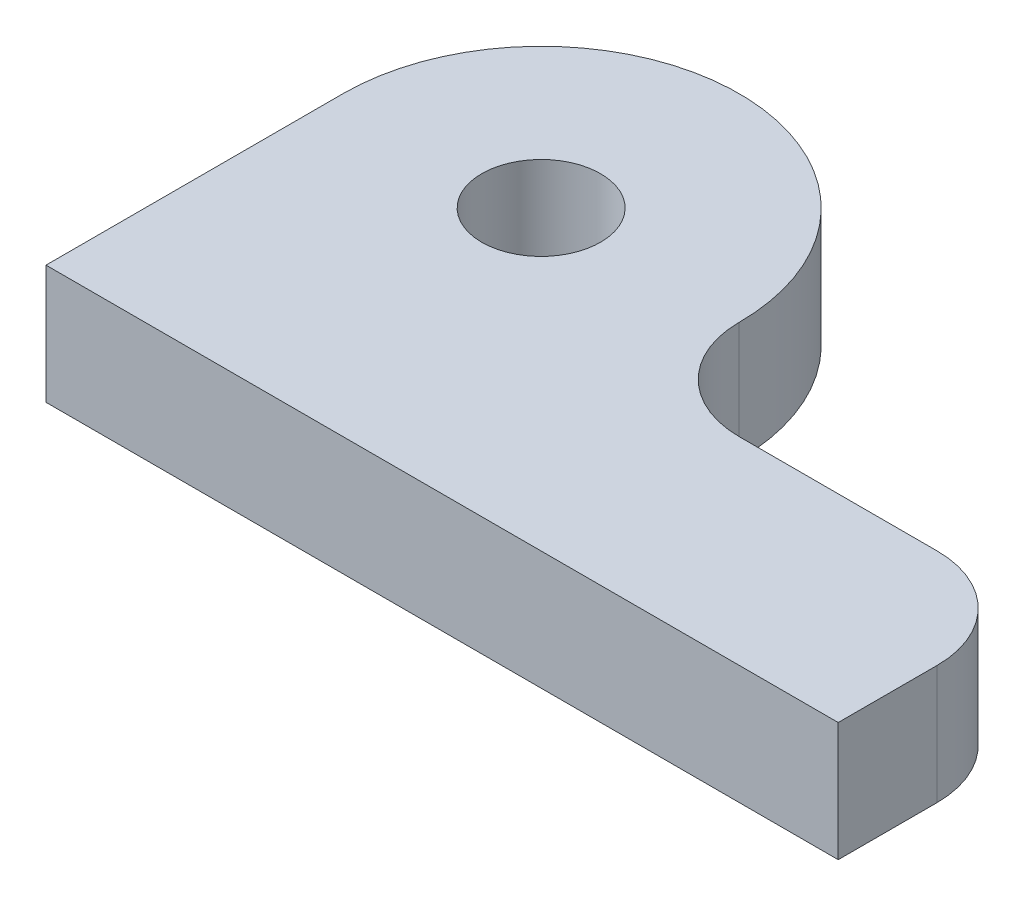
ISO-10303-21;
HEADER;
FILE_DESCRIPTION(('STEP AP214'),'2;1');
FILE_NAME('part.step','',(''),(''),'','','');
FILE_SCHEMA(('AUTOMOTIVE_DESIGN { 1 0 10303 214 1 1 1 1 }'));
ENDSEC;
DATA;
#1=APPLICATION_CONTEXT('core data for automotive mechanical design processes');
#2=APPLICATION_PROTOCOL_DEFINITION('international standard','automotive_design',2000,#1);
#3=PRODUCT_CONTEXT('',#1,'mechanical');
#4=PRODUCT('Part','Part','',(#3));
#5=PRODUCT_RELATED_PRODUCT_CATEGORY('part','',(#4));
#6=PRODUCT_DEFINITION_FORMATION('','',#4);
#7=PRODUCT_DEFINITION_CONTEXT('part definition',#1,'design');
#8=PRODUCT_DEFINITION('design','',#6,#7);
#9=PRODUCT_DEFINITION_SHAPE('','',#8);
#10=(LENGTH_UNIT() NAMED_UNIT(*) SI_UNIT(.MILLI.,.METRE.));
#11=(NAMED_UNIT(*) PLANE_ANGLE_UNIT() SI_UNIT($,.RADIAN.));
#12=(NAMED_UNIT(*) SI_UNIT($,.STERADIAN.) SOLID_ANGLE_UNIT());
#13=UNCERTAINTY_MEASURE_WITH_UNIT(LENGTH_MEASURE(1.E-05),#10,'distance_accuracy_value','');
#14=(GEOMETRIC_REPRESENTATION_CONTEXT(3) GLOBAL_UNCERTAINTY_ASSIGNED_CONTEXT((#13)) GLOBAL_UNIT_ASSIGNED_CONTEXT((#10,
#11,#12)) REPRESENTATION_CONTEXT('',''));
#15=CARTESIAN_POINT('',(0.,0.,0.));
#16=DIRECTION('',(0.,0.,1.));
#17=DIRECTION('',(1.,0.,0.));
#18=AXIS2_PLACEMENT_3D('',#15,#16,#17);
#19=CARTESIAN_POINT('',(10.,6.,-15.));
#20=DIRECTION('',(0.,1.,0.));
#21=DIRECTION('',(0.,0.,1.));
#22=AXIS2_PLACEMENT_3D('',#19,#20,#21);
#23=PLANE('',#22);
#24=CARTESIAN_POINT('',(10.,6.,-15.));
#25=DIRECTION('',(0.,1.,0.));
#26=DIRECTION('',(0.,0.,1.));
#27=AXIS2_PLACEMENT_3D('',#24,#25,#26);
#28=CIRCLE('',#27,10.);
#29=CARTESIAN_POINT('',(20.,6.,-15.));
#30=VERTEX_POINT('',#29);
#31=CARTESIAN_POINT('',(0.,6.,-15.));
#32=VERTEX_POINT('',#31);
#33=EDGE_CURVE('E111',#30,#32,#28,.T.);
#34=ORIENTED_EDGE('',*,*,#33,.T.);
#35=DIRECTION('',(0.,0.,1.));
#36=VECTOR('',#35,1.);
#37=CARTESIAN_POINT('',(0.,6.,0.));
#38=LINE('',#37,#36);
#39=CARTESIAN_POINT('',(0.,6.,0.));
#40=VERTEX_POINT('',#39);
#41=EDGE_CURVE('E90',#32,#40,#38,.T.);
#42=ORIENTED_EDGE('',*,*,#41,.T.);
#43=DIRECTION('',(1.,0.,0.));
#44=VECTOR('',#43,1.);
#45=CARTESIAN_POINT('',(40.,6.,0.));
#46=LINE('',#45,#44);
#47=CARTESIAN_POINT('',(40.,6.,0.));
#48=VERTEX_POINT('',#47);
#49=EDGE_CURVE('E114',#40,#48,#46,.T.);
#50=ORIENTED_EDGE('',*,*,#49,.T.);
#51=DIRECTION('',(0.,0.,-1.));
#52=VECTOR('',#51,1.);
#53=CARTESIAN_POINT('',(40.,6.,-4.99999999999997));
#54=LINE('',#53,#52);
#55=CARTESIAN_POINT('',(40.,6.,-4.99999999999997));
#56=VERTEX_POINT('',#55);
#57=EDGE_CURVE('E116',#48,#56,#54,.T.);
#58=ORIENTED_EDGE('',*,*,#57,.T.);
#59=CARTESIAN_POINT('',(35.,6.,-5.));
#60=DIRECTION('',(0.,1.,0.));
#61=DIRECTION('',(0.,0.,-1.));
#62=AXIS2_PLACEMENT_3D('',#59,#60,#61);
#63=CIRCLE('',#62,5.);
#64=CARTESIAN_POINT('',(35.,6.,-10.));
#65=VERTEX_POINT('',#64);
#66=EDGE_CURVE('E118',#56,#65,#63,.T.);
#67=ORIENTED_EDGE('',*,*,#66,.T.);
#68=DIRECTION('',(-1.,0.,0.));
#69=VECTOR('',#68,1.);
#70=CARTESIAN_POINT('',(25.,6.,-10.));
#71=LINE('',#70,#69);
#72=CARTESIAN_POINT('',(25.,6.,-10.));
#73=VERTEX_POINT('',#72);
#74=EDGE_CURVE('E37',#65,#73,#71,.T.);
#75=ORIENTED_EDGE('',*,*,#74,.T.);
#76=CARTESIAN_POINT('',(25.,6.,-15.));
#77=DIRECTION('',(0.,-1.,0.));
#78=DIRECTION('',(0.,0.,1.));
#79=AXIS2_PLACEMENT_3D('',#76,#77,#78);
#80=CIRCLE('',#79,5.);
#81=EDGE_CURVE('E32',#73,#30,#80,.T.);
#82=ORIENTED_EDGE('',*,*,#81,.T.);
#83=EDGE_LOOP('',(#34,#42,#50,#58,#67,#75,#82));
#84=FACE_BOUND('',#83,.T.);
#85=CARTESIAN_POINT('',(10.,6.,-15.));
#86=DIRECTION('',(0.,1.,0.));
#87=DIRECTION('',(0.,0.,1.));
#88=AXIS2_PLACEMENT_3D('',#85,#86,#87);
#89=CIRCLE('',#88,3.);
#90=CARTESIAN_POINT('',(10.,6.,-12.));
#91=VERTEX_POINT('',#90);
#92=EDGE_CURVE('E95',#91,#91,#89,.T.);
#93=ORIENTED_EDGE('',*,*,#92,.F.);
#94=EDGE_LOOP('',(#93));
#95=FACE_BOUND('',#94,.T.);
#96=ADVANCED_FACE('F17',(#84,#95),#23,.T.);
#97=CARTESIAN_POINT('',(10.,0.,-15.));
#98=DIRECTION('',(0.,1.,0.));
#99=DIRECTION('',(0.,0.,1.));
#100=AXIS2_PLACEMENT_3D('',#97,#98,#99);
#101=PLANE('',#100);
#102=CARTESIAN_POINT('',(10.,0.,-15.));
#103=DIRECTION('',(0.,1.,0.));
#104=DIRECTION('',(0.,0.,1.));
#105=AXIS2_PLACEMENT_3D('',#102,#103,#104);
#106=CIRCLE('',#105,10.);
#107=CARTESIAN_POINT('',(20.,0.,-15.));
#108=VERTEX_POINT('',#107);
#109=CARTESIAN_POINT('',(0.,0.,-15.));
#110=VERTEX_POINT('',#109);
#111=EDGE_CURVE('E81',#108,#110,#106,.T.);
#112=ORIENTED_EDGE('',*,*,#111,.F.);
#113=CARTESIAN_POINT('',(25.,0.,-15.));
#114=DIRECTION('',(0.,-1.,0.));
#115=DIRECTION('',(0.,0.,1.));
#116=AXIS2_PLACEMENT_3D('',#113,#114,#115);
#117=CIRCLE('',#116,5.);
#118=CARTESIAN_POINT('',(25.,0.,-10.));
#119=VERTEX_POINT('',#118);
#120=EDGE_CURVE('E109',#119,#108,#117,.T.);
#121=ORIENTED_EDGE('',*,*,#120,.F.);
#122=DIRECTION('',(-1.,0.,0.));
#123=VECTOR('',#122,1.);
#124=CARTESIAN_POINT('',(25.,0.,-10.));
#125=LINE('',#124,#123);
#126=CARTESIAN_POINT('',(35.,0.,-10.));
#127=VERTEX_POINT('',#126);
#128=EDGE_CURVE('E107',#127,#119,#125,.T.);
#129=ORIENTED_EDGE('',*,*,#128,.F.);
#130=CARTESIAN_POINT('',(35.,0.,-5.));
#131=DIRECTION('',(0.,1.,0.));
#132=DIRECTION('',(0.,0.,-1.));
#133=AXIS2_PLACEMENT_3D('',#130,#131,#132);
#134=CIRCLE('',#133,5.);
#135=CARTESIAN_POINT('',(40.,0.,-4.99999999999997));
#136=VERTEX_POINT('',#135);
#137=EDGE_CURVE('E105',#136,#127,#134,.T.);
#138=ORIENTED_EDGE('',*,*,#137,.F.);
#139=DIRECTION('',(0.,0.,-1.));
#140=VECTOR('',#139,1.);
#141=CARTESIAN_POINT('',(40.,0.,-4.99999999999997));
#142=LINE('',#141,#140);
#143=CARTESIAN_POINT('',(40.,0.,0.));
#144=VERTEX_POINT('',#143);
#145=EDGE_CURVE('E103',#144,#136,#142,.T.);
#146=ORIENTED_EDGE('',*,*,#145,.F.);
#147=DIRECTION('',(1.,0.,0.));
#148=VECTOR('',#147,1.);
#149=CARTESIAN_POINT('',(40.,0.,0.));
#150=LINE('',#149,#148);
#151=CARTESIAN_POINT('',(0.,0.,0.));
#152=VERTEX_POINT('',#151);
#153=EDGE_CURVE('E83',#152,#144,#150,.T.);
#154=ORIENTED_EDGE('',*,*,#153,.F.);
#155=DIRECTION('',(0.,0.,1.));
#156=VECTOR('',#155,1.);
#157=CARTESIAN_POINT('',(0.,0.,0.));
#158=LINE('',#157,#156);
#159=EDGE_CURVE('E76',#110,#152,#158,.T.);
#160=ORIENTED_EDGE('',*,*,#159,.F.);
#161=EDGE_LOOP('',(#112,#121,#129,#138,#146,#154,#160));
#162=FACE_BOUND('',#161,.T.);
#163=CARTESIAN_POINT('',(10.,0.,-15.));
#164=DIRECTION('',(0.,1.,0.));
#165=DIRECTION('',(0.,0.,1.));
#166=AXIS2_PLACEMENT_3D('',#163,#164,#165);
#167=CIRCLE('',#166,3.);
#168=CARTESIAN_POINT('',(10.,0.,-12.));
#169=VERTEX_POINT('',#168);
#170=EDGE_CURVE('E98',#169,#169,#167,.T.);
#171=ORIENTED_EDGE('',*,*,#170,.T.);
#172=EDGE_LOOP('',(#171));
#173=FACE_BOUND('',#172,.T.);
#174=ADVANCED_FACE('F77',(#162,#173),#101,.F.);
#175=CARTESIAN_POINT('',(10.,6.,-15.));
#176=DIRECTION('',(0.,-1.,0.));
#177=DIRECTION('',(0.,0.,-1.));
#178=AXIS2_PLACEMENT_3D('',#175,#176,#177);
#179=CYLINDRICAL_SURFACE('',#178,10.);
#180=ORIENTED_EDGE('',*,*,#111,.T.);
#181=DIRECTION('',(0.,-1.,0.));
#182=VECTOR('',#181,1.);
#183=CARTESIAN_POINT('',(0.,6.,-15.));
#184=LINE('',#183,#182);
#185=EDGE_CURVE('E11',#32,#110,#184,.T.);
#186=ORIENTED_EDGE('',*,*,#185,.F.);
#187=ORIENTED_EDGE('',*,*,#33,.F.);
#188=DIRECTION('',(0.,-1.,0.));
#189=VECTOR('',#188,1.);
#190=CARTESIAN_POINT('',(20.,6.,-15.));
#191=LINE('',#190,#189);
#192=EDGE_CURVE('E94',#30,#108,#191,.T.);
#193=ORIENTED_EDGE('',*,*,#192,.T.);
#194=EDGE_LOOP('',(#180,#186,#187,#193));
#195=FACE_BOUND('',#194,.T.);
#196=ADVANCED_FACE('F19',(#195),#179,.T.);
#197=CARTESIAN_POINT('',(0.,6.,0.));
#198=DIRECTION('',(1.,0.,0.));
#199=DIRECTION('',(0.,0.,-1.));
#200=AXIS2_PLACEMENT_3D('',#197,#198,#199);
#201=PLANE('',#200);
#202=ORIENTED_EDGE('',*,*,#159,.T.);
#203=DIRECTION('',(0.,-1.,0.));
#204=VECTOR('',#203,1.);
#205=CARTESIAN_POINT('',(0.,6.,0.));
#206=LINE('',#205,#204);
#207=EDGE_CURVE('E25',#40,#152,#206,.T.);
#208=ORIENTED_EDGE('',*,*,#207,.F.);
#209=ORIENTED_EDGE('',*,*,#41,.F.);
#210=ORIENTED_EDGE('',*,*,#185,.T.);
#211=EDGE_LOOP('',(#202,#208,#209,#210));
#212=FACE_BOUND('',#211,.T.);
#213=ADVANCED_FACE('F89',(#212),#201,.F.);
#214=CARTESIAN_POINT('',(40.,6.,0.));
#215=DIRECTION('',(0.,0.,-1.));
#216=DIRECTION('',(-1.,0.,0.));
#217=AXIS2_PLACEMENT_3D('',#214,#215,#216);
#218=PLANE('',#217);
#219=ORIENTED_EDGE('',*,*,#153,.T.);
#220=DIRECTION('',(0.,-1.,0.));
#221=VECTOR('',#220,1.);
#222=CARTESIAN_POINT('',(40.,6.,0.));
#223=LINE('',#222,#221);
#224=EDGE_CURVE('E132',#48,#144,#223,.T.);
#225=ORIENTED_EDGE('',*,*,#224,.F.);
#226=ORIENTED_EDGE('',*,*,#49,.F.);
#227=ORIENTED_EDGE('',*,*,#207,.T.);
#228=EDGE_LOOP('',(#219,#225,#226,#227));
#229=FACE_BOUND('',#228,.T.);
#230=ADVANCED_FACE('F136',(#229),#218,.F.);
#231=CARTESIAN_POINT('',(40.,6.,-4.99999999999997));
#232=DIRECTION('',(-1.,0.,0.));
#233=DIRECTION('',(0.,0.,1.));
#234=AXIS2_PLACEMENT_3D('',#231,#232,#233);
#235=PLANE('',#234);
#236=ORIENTED_EDGE('',*,*,#145,.T.);
#237=DIRECTION('',(0.,-1.,0.));
#238=VECTOR('',#237,1.);
#239=CARTESIAN_POINT('',(40.,6.,-4.99999999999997));
#240=LINE('',#239,#238);
#241=EDGE_CURVE('E129',#56,#136,#240,.T.);
#242=ORIENTED_EDGE('',*,*,#241,.F.);
#243=ORIENTED_EDGE('',*,*,#57,.F.);
#244=ORIENTED_EDGE('',*,*,#224,.T.);
#245=EDGE_LOOP('',(#236,#242,#243,#244));
#246=FACE_BOUND('',#245,.T.);
#247=ADVANCED_FACE('F144',(#246),#235,.F.);
#248=CARTESIAN_POINT('',(35.,6.,-5.));
#249=DIRECTION('',(0.,-1.,0.));
#250=DIRECTION('',(0.,0.,-1.));
#251=AXIS2_PLACEMENT_3D('',#248,#249,#250);
#252=CYLINDRICAL_SURFACE('',#251,5.);
#253=ORIENTED_EDGE('',*,*,#137,.T.);
#254=DIRECTION('',(0.,-1.,0.));
#255=VECTOR('',#254,1.);
#256=CARTESIAN_POINT('',(35.,6.,-10.));
#257=LINE('',#256,#255);
#258=EDGE_CURVE('E126',#65,#127,#257,.T.);
#259=ORIENTED_EDGE('',*,*,#258,.F.);
#260=ORIENTED_EDGE('',*,*,#66,.F.);
#261=ORIENTED_EDGE('',*,*,#241,.T.);
#262=EDGE_LOOP('',(#253,#259,#260,#261));
#263=FACE_BOUND('',#262,.T.);
#264=ADVANCED_FACE('F147',(#263),#252,.T.);
#265=CARTESIAN_POINT('',(25.,6.,-10.));
#266=DIRECTION('',(0.,0.,1.));
#267=DIRECTION('',(1.,0.,0.));
#268=AXIS2_PLACEMENT_3D('',#265,#266,#267);
#269=PLANE('',#268);
#270=ORIENTED_EDGE('',*,*,#128,.T.);
#271=DIRECTION('',(0.,-1.,0.));
#272=VECTOR('',#271,1.);
#273=CARTESIAN_POINT('',(25.,6.,-10.));
#274=LINE('',#273,#272);
#275=EDGE_CURVE('E123',#73,#119,#274,.T.);
#276=ORIENTED_EDGE('',*,*,#275,.F.);
#277=ORIENTED_EDGE('',*,*,#74,.F.);
#278=ORIENTED_EDGE('',*,*,#258,.T.);
#279=EDGE_LOOP('',(#270,#276,#277,#278));
#280=FACE_BOUND('',#279,.T.);
#281=ADVANCED_FACE('F150',(#280),#269,.F.);
#282=CARTESIAN_POINT('',(25.,6.,-15.));
#283=DIRECTION('',(0.,-1.,0.));
#284=DIRECTION('',(0.,0.,-1.));
#285=AXIS2_PLACEMENT_3D('',#282,#283,#284);
#286=CYLINDRICAL_SURFACE('',#285,5.);
#287=ORIENTED_EDGE('',*,*,#120,.T.);
#288=ORIENTED_EDGE('',*,*,#192,.F.);
#289=ORIENTED_EDGE('',*,*,#81,.F.);
#290=ORIENTED_EDGE('',*,*,#275,.T.);
#291=EDGE_LOOP('',(#287,#288,#289,#290));
#292=FACE_BOUND('',#291,.T.);
#293=ADVANCED_FACE('F152',(#292),#286,.F.);
#294=CARTESIAN_POINT('',(10.,6.,-15.));
#295=DIRECTION('',(0.,-1.,0.));
#296=DIRECTION('',(0.,0.,-1.));
#297=AXIS2_PLACEMENT_3D('',#294,#295,#296);
#298=CYLINDRICAL_SURFACE('',#297,3.);
#299=ORIENTED_EDGE('',*,*,#92,.T.);
#300=EDGE_LOOP('',(#299));
#301=FACE_BOUND('',#300,.T.);
#302=ORIENTED_EDGE('',*,*,#170,.F.);
#303=EDGE_LOOP('',(#302));
#304=FACE_BOUND('',#303,.T.);
#305=ADVANCED_FACE('F154',(#301,#304),#298,.F.);
#306=CLOSED_SHELL('',(#96,#174,#196,#213,#230,#247,#264,#281,#293,#305));
#307=MANIFOLD_SOLID_BREP('B1',#306);
#308=ADVANCED_BREP_SHAPE_REPRESENTATION('',(#18,#307),#14);
#309=SHAPE_DEFINITION_REPRESENTATION(#9,#308);
ENDSEC;
END-ISO-10303-21;
